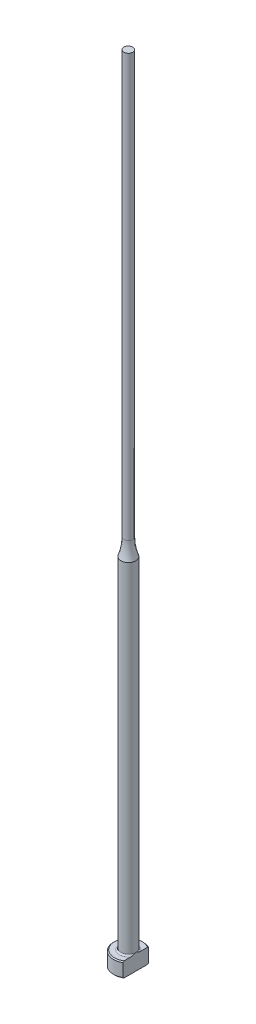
from build123d import *
from build123d.topology import SkipClean

# Parameters (mm, degrees)
CHAMFER1_SIZE = 0.2
FILLET1_R     = 0.3
KEY_DEPTH     = 161.056240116


with BuildPart() as part:
    # Sketch1 → Revolve1 (revolve)
    with BuildSketch(Plane.XY, mode=Mode.PRIVATE) as revolve1_sk:
        with BuildLine():
            Line((0, 0), (-3, 0))
            Line((-3, 0), (-3, 3))
            Line((-3, 3), (-1.5, 3))
            Line((-1.5, 3), (-1.5, 71.588255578))
            ThreePointArc((-1.5, 71.588255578), (-1.051142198, 73.267949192), (-0.9, 75))
            Line((-0.9, 75), (-0.9, 160))
            Line((-0.9, 160), (0, 160))
            Line((0, 160), (0, 0))
        make_face()
    revolve(revolve1_sk.sketch.rotate(Axis((0, 259.958771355, 0), (0, -1, 0)), 270), axis=Axis((0, 259.958771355, 0), (0, -1, 0)))

    # Chamfer1
    chamfer1_edges = [part.edges().sort_by_distance(p)[0] for p in [
        (0, 0, -3),
        (0, 3, -3),
    ]]
    chamfer(chamfer1_edges, length=CHAMFER1_SIZE)

    # Fillet1
    fillet1_edges = [part.edges().sort_by_distance(p)[0] for p in [
        (0, 3, -1.5),
    ]]
    fillet(fillet1_edges, radius=FILLET1_R)

    # Sketch2 → KEY (cut, through all)
    with SkipClean():  # the faces are left unmerged after this step: merging them gives an invalid solid
        with BuildSketch(Plane(origin=(0, 0, 0), x_dir=(1, 0, 0), z_dir=(0, 1, 0))):
            with BuildLine():
                Line((1.5, 2.598076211), (1.5, -2.598076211))
                ThreePointArc((1.5, -2.598076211), (3, 0), (1.5, 2.598076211))
            make_face()
        extrude(amount=KEY_DEPTH, mode=Mode.SUBTRACT)


solid = part.part
